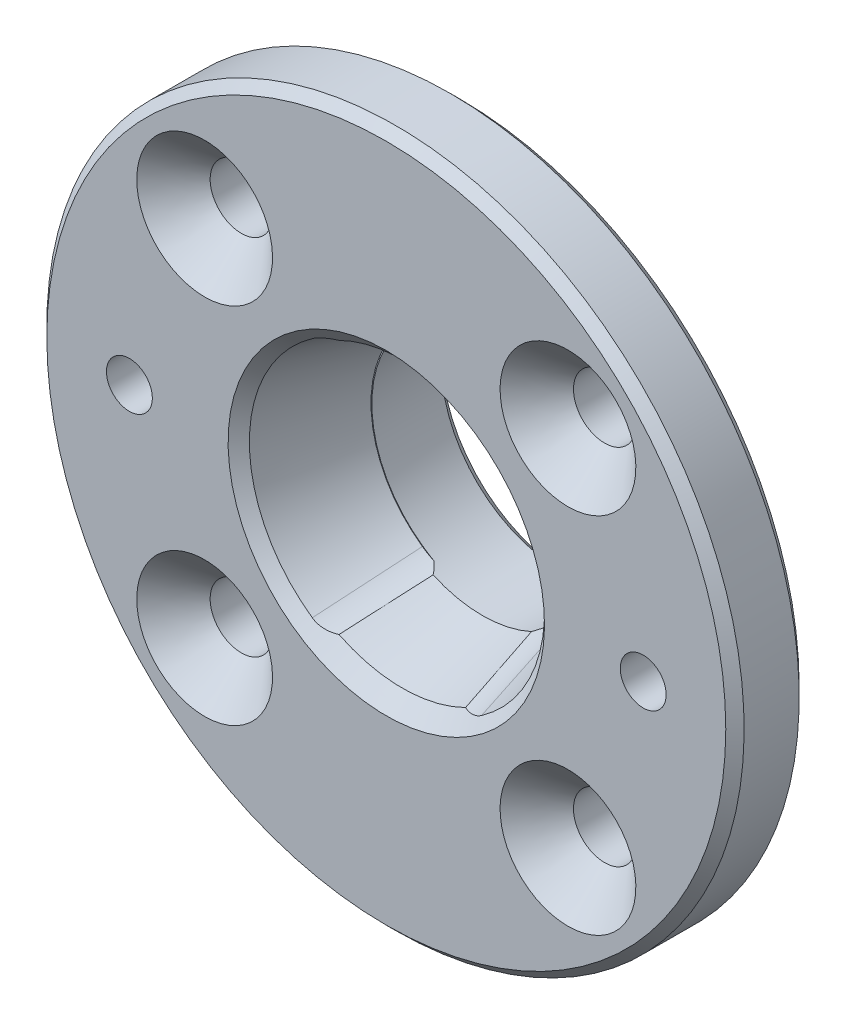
ISO-10303-21;
HEADER;
FILE_DESCRIPTION(('STEP AP214'),'2;1');
FILE_NAME('part.step','',(''),(''),'','','');
FILE_SCHEMA(('AUTOMOTIVE_DESIGN { 1 0 10303 214 1 1 1 1 }'));
ENDSEC;
DATA;
#1=APPLICATION_CONTEXT('core data for automotive mechanical design processes');
#2=APPLICATION_PROTOCOL_DEFINITION('international standard','automotive_design',2000,#1);
#3=PRODUCT_CONTEXT('',#1,'mechanical');
#4=PRODUCT('Part','Part','',(#3));
#5=PRODUCT_RELATED_PRODUCT_CATEGORY('part','',(#4));
#6=PRODUCT_DEFINITION_FORMATION('','',#4);
#7=PRODUCT_DEFINITION_CONTEXT('part definition',#1,'design');
#8=PRODUCT_DEFINITION('design','',#6,#7);
#9=PRODUCT_DEFINITION_SHAPE('','',#8);
#10=(LENGTH_UNIT() NAMED_UNIT(*) SI_UNIT(.MILLI.,.METRE.));
#11=(NAMED_UNIT(*) PLANE_ANGLE_UNIT() SI_UNIT($,.RADIAN.));
#12=(NAMED_UNIT(*) SI_UNIT($,.STERADIAN.) SOLID_ANGLE_UNIT());
#13=UNCERTAINTY_MEASURE_WITH_UNIT(LENGTH_MEASURE(1.E-05),#10,'distance_accuracy_value','');
#14=(GEOMETRIC_REPRESENTATION_CONTEXT(3) GLOBAL_UNCERTAINTY_ASSIGNED_CONTEXT((#13)) GLOBAL_UNIT_ASSIGNED_CONTEXT((#10,
#11,#12)) REPRESENTATION_CONTEXT('',''));
#15=CARTESIAN_POINT('',(0.,0.,0.));
#16=DIRECTION('',(0.,0.,1.));
#17=DIRECTION('',(1.,0.,0.));
#18=AXIS2_PLACEMENT_3D('',#15,#16,#17);
#19=CARTESIAN_POINT('',(0.,0.,-5.23112166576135));
#20=DIRECTION('',(0.,0.,1.));
#21=DIRECTION('',(0.,-1.,0.));
#22=AXIS2_PLACEMENT_3D('',#19,#20,#21);
#23=CONICAL_SURFACE('',#22,6.5,0.279252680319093);
#24=CARTESIAN_POINT('',(0.,0.,-0.871853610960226));
#25=DIRECTION('',(0.,0.,-1.));
#26=DIRECTION('',(0.,1.,0.));
#27=AXIS2_PLACEMENT_3D('',#24,#25,#26);
#28=CIRCLE('',#27,7.75);
#29=CARTESIAN_POINT('',(-3.44849992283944,6.94048617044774,-0.87185361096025));
#30=VERTEX_POINT('',#29);
#31=CARTESIAN_POINT('',(3.44849992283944,6.94048617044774,-0.87185361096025));
#32=VERTEX_POINT('',#31);
#33=EDGE_CURVE('E106',#30,#32,#28,.T.);
#34=ORIENTED_EDGE('',*,*,#33,.F.);
#35=CARTESIAN_POINT('',(-2.67969673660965,5.92186455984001,-5.23132166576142));
#36=CARTESIAN_POINT('',(-2.75792268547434,6.02359861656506,-4.79560211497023));
#37=CARTESIAN_POINT('',(-2.8356512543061,6.12537486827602,-4.3598034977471));
#38=CARTESIAN_POINT('',(-2.9902842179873,6.32900252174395,-3.48807864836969));
#39=CARTESIAN_POINT('',(-3.06718861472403,6.43085392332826,-3.05215241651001));
#40=CARTESIAN_POINT('',(-3.22034411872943,6.6346230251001,-2.18020119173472));
#41=CARTESIAN_POINT('',(-3.29659522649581,6.73654072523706,-1.74417619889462));
#42=CARTESIAN_POINT('',(-3.44855596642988,6.9404349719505,-0.872044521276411));
#43=CARTESIAN_POINT('',(-3.5242655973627,7.04241151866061,-0.435937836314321));
#44=CARTESIAN_POINT('',(-3.59976019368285,7.14441349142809,0.000199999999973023));
#45=B_SPLINE_CURVE_WITH_KNOTS('',3,(#35,#36,#37,#38,#39,#40,#41,#42,#43,#44),.UNSPECIFIED.,.F.,
.F.,(4,2,2,2,4),(0.,1.3626751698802,2.72534721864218,4.08801822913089,5.45069234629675),.UNSPECIFIED.);
#46=CARTESIAN_POINT('',(-2.67973264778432,5.92191125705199,-5.23112166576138));
#47=VERTEX_POINT('',#46);
#48=EDGE_CURVE('E245',#47,#30,#45,.T.);
#49=ORIENTED_EDGE('',*,*,#48,.F.);
#50=CARTESIAN_POINT('',(0.,0.,-5.23112166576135));
#51=DIRECTION('',(0.,0.,1.));
#52=DIRECTION('',(0.,-1.,0.));
#53=AXIS2_PLACEMENT_3D('',#50,#51,#52);
#54=CIRCLE('',#53,6.5);
#55=CARTESIAN_POINT('',(2.67973264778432,5.92191125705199,-5.23112166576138));
#56=VERTEX_POINT('',#55);
#57=EDGE_CURVE('E126',#56,#47,#54,.T.);
#58=ORIENTED_EDGE('',*,*,#57,.F.);
#59=CARTESIAN_POINT('',(3.59976019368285,7.14441349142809,0.000199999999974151));
#60=CARTESIAN_POINT('',(3.5242655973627,7.04241151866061,-0.435937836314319));
#61=CARTESIAN_POINT('',(3.44855596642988,6.9404349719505,-0.872044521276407));
#62=CARTESIAN_POINT('',(3.29659522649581,6.73654072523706,-1.74417619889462));
#63=CARTESIAN_POINT('',(3.22034411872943,6.6346230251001,-2.18020119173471));
#64=CARTESIAN_POINT('',(3.06718861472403,6.43085392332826,-3.05215241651));
#65=CARTESIAN_POINT('',(2.99028421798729,6.32900252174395,-3.48807864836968));
#66=CARTESIAN_POINT('',(2.8356512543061,6.12537486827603,-4.35980349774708));
#67=CARTESIAN_POINT('',(2.75792268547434,6.02359861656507,-4.79560211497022));
#68=CARTESIAN_POINT('',(2.67969673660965,5.92186455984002,-5.2313216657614));
#69=B_SPLINE_CURVE_WITH_KNOTS('',3,(#59,#60,#61,#62,#63,#64,#65,#66,#67,#68),.UNSPECIFIED.,.F.,
.F.,(4,2,2,2,4),(0.,1.36267411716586,2.72534512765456,4.08801717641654,5.45069234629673),.UNSPECIFIED.);
#70=EDGE_CURVE('E119',#32,#56,#69,.T.);
#71=ORIENTED_EDGE('',*,*,#70,.F.);
#72=EDGE_LOOP('',(#34,#49,#58,#71));
#73=FACE_BOUND('',#72,.T.);
#74=ADVANCED_FACE('F16',(#73),#23,.F.);
#75=CARTESIAN_POINT('',(0.,0.,0.));
#76=DIRECTION('',(0.,0.,1.));
#77=DIRECTION('',(0.,-1.,0.));
#78=AXIS2_PLACEMENT_3D('',#75,#76,#77);
#79=CYLINDRICAL_SURFACE('',#78,6.5);
#80=CARTESIAN_POINT('',(0.,0.,-3.84872790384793));
#81=DIRECTION('',(0.15809909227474,0.225788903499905,-0.96126169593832));
#82=DIRECTION('',(0.551357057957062,0.787419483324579,0.275637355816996));
#83=AXIS2_PLACEMENT_3D('',#80,#81,#82);
#84=ELLIPSE('',#83,6.76194633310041,6.5);
#85=CARTESIAN_POINT('',(-3.10143057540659,-5.71236626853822,-5.70058810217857));
#86=VERTEX_POINT('',#85);
#87=CARTESIAN_POINT('',(-3.72824683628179,-5.32448828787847,-5.71257291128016));
#88=VERTEX_POINT('',#87);
#89=EDGE_CURVE('E323',#86,#88,#84,.T.);
#90=ORIENTED_EDGE('',*,*,#89,.F.);
#91=CARTESIAN_POINT('',(-2.67973264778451,-5.9219112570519,-5.23112166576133));
#92=CARTESIAN_POINT('',(-2.7105630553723,-5.90795561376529,-5.27541786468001));
#93=CARTESIAN_POINT('',(-2.74241721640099,-5.89325556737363,-5.31880643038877));
#94=CARTESIAN_POINT('',(-2.80811794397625,-5.86223503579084,-5.40301267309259));
#95=CARTESIAN_POINT('',(-2.84195237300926,-5.84592407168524,-5.44384336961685));
#96=CARTESIAN_POINT('',(-2.91191436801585,-5.8113919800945,-5.52270075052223));
#97=CARTESIAN_POINT('',(-2.94804283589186,-5.79317009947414,-5.56072631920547));
#98=CARTESIAN_POINT('',(-3.02284584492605,-5.75449149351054,-5.63343217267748));
#99=CARTESIAN_POINT('',(-3.06153357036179,-5.73402276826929,-5.66809242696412));
#100=CARTESIAN_POINT('',(-3.1014305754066,-5.71236626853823,-5.70058810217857));
#101=B_SPLINE_CURVE_WITH_KNOTS('',3,(#91,#92,#93,#94,#95,#96,#97,#98,#99,#100),.UNSPECIFIED.,
.F.,.F.,(4,2,2,2,4),(0.,0.167255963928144,0.333576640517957,0.49996311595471,0.667285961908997),.UNSPECIFIED.);
#102=CARTESIAN_POINT('',(-2.67973264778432,-5.92191125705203,-5.23112166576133));
#103=VERTEX_POINT('',#102);
#104=EDGE_CURVE('E836',#103,#86,#101,.T.);
#105=ORIENTED_EDGE('',*,*,#104,.F.);
#106=CARTESIAN_POINT('',(2.67973264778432,-5.92191125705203,-5.23112166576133));
#107=VERTEX_POINT('',#106);
#108=EDGE_CURVE('E328',#103,#107,#54,.T.);
#109=ORIENTED_EDGE('',*,*,#108,.T.);
#110=CARTESIAN_POINT('',(3.10143057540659,-5.71236626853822,-5.70058810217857));
#111=CARTESIAN_POINT('',(3.06153357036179,-5.73402276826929,-5.66809242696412));
#112=CARTESIAN_POINT('',(3.02284584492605,-5.75449149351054,-5.63343217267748));
#113=CARTESIAN_POINT('',(2.94804283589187,-5.79317009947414,-5.56072631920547));
#114=CARTESIAN_POINT('',(2.91191436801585,-5.8113919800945,-5.52270075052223));
#115=CARTESIAN_POINT('',(2.84195237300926,-5.84592407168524,-5.44384336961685));
#116=CARTESIAN_POINT('',(2.80811794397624,-5.86223503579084,-5.40301267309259));
#117=CARTESIAN_POINT('',(2.74241721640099,-5.89325556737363,-5.31880643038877));
#118=CARTESIAN_POINT('',(2.7105630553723,-5.90795561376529,-5.27541786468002));
#119=CARTESIAN_POINT('',(2.67973264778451,-5.9219112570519,-5.23112166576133));
#120=B_SPLINE_CURVE_WITH_KNOTS('',3,(#110,#111,#112,#113,#114,#115,#116,#117,#118,#119),
.UNSPECIFIED.,.F.,.F.,(4,2,2,2,4),(0.,0.167322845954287,0.333709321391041,0.500029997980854,
0.667285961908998),.UNSPECIFIED.);
#121=CARTESIAN_POINT('',(3.10143057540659,-5.71236626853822,-5.70058810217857));
#122=VERTEX_POINT('',#121);
#123=EDGE_CURVE('E218',#122,#107,#120,.T.);
#124=ORIENTED_EDGE('',*,*,#123,.F.);
#125=CARTESIAN_POINT('',(0.,0.,-3.84872790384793));
#126=DIRECTION('',(-0.15809909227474,0.225788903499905,-0.96126169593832));
#127=DIRECTION('',(-0.551357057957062,0.787419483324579,0.275637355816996));
#128=AXIS2_PLACEMENT_3D('',#125,#126,#127);
#129=ELLIPSE('',#128,6.76194633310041,6.5);
#130=CARTESIAN_POINT('',(3.72824683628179,-5.32448828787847,-5.71257291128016));
#131=VERTEX_POINT('',#130);
#132=EDGE_CURVE('E132',#131,#122,#129,.T.);
#133=ORIENTED_EDGE('',*,*,#132,.F.);
#134=CARTESIAN_POINT('',(0.,0.,-5.71257291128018));
#135=DIRECTION('',(0.,0.,-1.));
#136=DIRECTION('',(0.,1.,0.));
#137=AXIS2_PLACEMENT_3D('',#134,#135,#136);
#138=CIRCLE('',#137,6.5);
#139=CARTESIAN_POINT('',(3.72824683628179,5.32448828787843,-5.7125729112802));
#140=VERTEX_POINT('',#139);
#141=EDGE_CURVE('E357',#131,#140,#138,.F.);
#142=ORIENTED_EDGE('',*,*,#141,.T.);
#143=CARTESIAN_POINT('',(0.,0.,-3.84872790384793));
#144=DIRECTION('',(-0.15809909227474,-0.225788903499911,-0.961261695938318));
#145=DIRECTION('',(-0.551357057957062,-0.787419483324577,0.275637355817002));
#146=AXIS2_PLACEMENT_3D('',#143,#144,#145);
#147=ELLIPSE('',#146,6.76194633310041,6.5);
#148=CARTESIAN_POINT('',(3.10143057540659,5.71236626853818,-5.70058810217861));
#149=VERTEX_POINT('',#148);
#150=EDGE_CURVE('E130',#149,#140,#147,.T.);
#151=ORIENTED_EDGE('',*,*,#150,.F.);
#152=CARTESIAN_POINT('',(2.67973264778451,5.92191125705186,-5.23112166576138));
#153=CARTESIAN_POINT('',(2.7105630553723,5.90795561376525,-5.27541786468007));
#154=CARTESIAN_POINT('',(2.74241721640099,5.89325556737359,-5.31880643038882));
#155=CARTESIAN_POINT('',(2.80811794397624,5.8622350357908,-5.40301267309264));
#156=CARTESIAN_POINT('',(2.84195237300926,5.8459240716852,-5.44384336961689));
#157=CARTESIAN_POINT('',(2.91191436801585,5.81139198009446,-5.52270075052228));
#158=CARTESIAN_POINT('',(2.94804283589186,5.7931700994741,-5.56072631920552));
#159=CARTESIAN_POINT('',(3.02284584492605,5.7544914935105,-5.63343217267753));
#160=CARTESIAN_POINT('',(3.06153357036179,5.73402276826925,-5.66809242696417));
#161=CARTESIAN_POINT('',(3.1014305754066,5.71236626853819,-5.70058810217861));
#162=B_SPLINE_CURVE_WITH_KNOTS('',3,(#152,#153,#154,#155,#156,#157,#158,#159,#160,#161),
.UNSPECIFIED.,.F.,.F.,(4,2,2,2,4),(0.,0.167255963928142,0.333576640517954,0.499963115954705,
0.667285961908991),.UNSPECIFIED.);
#163=EDGE_CURVE('E127',#56,#149,#162,.T.);
#164=ORIENTED_EDGE('',*,*,#163,.F.);
#165=ORIENTED_EDGE('',*,*,#57,.T.);
#166=CARTESIAN_POINT('',(-3.10143057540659,5.71236626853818,-5.70058810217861));
#167=CARTESIAN_POINT('',(-3.06153357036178,5.73402276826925,-5.66809242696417));
#168=CARTESIAN_POINT('',(-3.02284584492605,5.7544914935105,-5.63343217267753));
#169=CARTESIAN_POINT('',(-2.94804283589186,5.7931700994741,-5.56072631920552));
#170=CARTESIAN_POINT('',(-2.91191436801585,5.81139198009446,-5.52270075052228));
#171=CARTESIAN_POINT('',(-2.84195237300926,5.8459240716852,-5.44384336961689));
#172=CARTESIAN_POINT('',(-2.80811794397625,5.8622350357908,-5.40301267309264));
#173=CARTESIAN_POINT('',(-2.74241721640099,5.89325556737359,-5.31880643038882));
#174=CARTESIAN_POINT('',(-2.7105630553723,5.90795561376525,-5.27541786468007));
#175=CARTESIAN_POINT('',(-2.67973264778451,5.92191125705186,-5.23112166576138));
#176=B_SPLINE_CURVE_WITH_KNOTS('',3,(#166,#167,#168,#169,#170,#171,#172,#173,#174,#175),
.UNSPECIFIED.,.F.,.F.,(4,2,2,2,4),(0.,0.167322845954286,0.333709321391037,0.500029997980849,
0.667285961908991),.UNSPECIFIED.);
#177=CARTESIAN_POINT('',(-3.10143057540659,5.71236626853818,-5.70058810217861));
#178=VERTEX_POINT('',#177);
#179=EDGE_CURVE('E237',#178,#47,#176,.T.);
#180=ORIENTED_EDGE('',*,*,#179,.F.);
#181=CARTESIAN_POINT('',(0.,0.,-3.84872790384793));
#182=DIRECTION('',(0.15809909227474,-0.225788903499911,-0.961261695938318));
#183=DIRECTION('',(0.551357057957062,-0.787419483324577,0.275637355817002));
#184=AXIS2_PLACEMENT_3D('',#181,#182,#183);
#185=ELLIPSE('',#184,6.76194633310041,6.5);
#186=CARTESIAN_POINT('',(-3.72824683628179,5.32448828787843,-5.7125729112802));
#187=VERTEX_POINT('',#186);
#188=EDGE_CURVE('E244',#187,#178,#185,.T.);
#189=ORIENTED_EDGE('',*,*,#188,.F.);
#190=CARTESIAN_POINT('',(0.,0.,-5.71257291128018));
#191=DIRECTION('',(0.,0.,-1.));
#192=DIRECTION('',(0.,1.,0.));
#193=AXIS2_PLACEMENT_3D('',#190,#191,#192);
#194=CIRCLE('',#193,6.5);
#195=EDGE_CURVE('E359',#187,#88,#194,.F.);
#196=ORIENTED_EDGE('',*,*,#195,.T.);
#197=EDGE_LOOP('',(#90,#105,#109,#124,#133,#142,#151,#164,#165,#180,#189,#196));
#198=FACE_BOUND('',#197,.T.);
#199=CARTESIAN_POINT('',(0.,0.,-9.5));
#200=DIRECTION('',(0.,0.,-1.));
#201=DIRECTION('',(0.,1.,0.));
#202=AXIS2_PLACEMENT_3D('',#199,#200,#201);
#203=CIRCLE('',#202,6.5);
#204=CARTESIAN_POINT('',(0.,6.49999999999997,-9.50000000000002));
#205=VERTEX_POINT('',#204);
#206=EDGE_CURVE('E348',#205,#205,#203,.T.);
#207=ORIENTED_EDGE('',*,*,#206,.T.);
#208=EDGE_LOOP('',(#207));
#209=FACE_BOUND('',#208,.T.);
#210=ADVANCED_FACE('F224',(#198,#209),#79,.F.);
#211=CARTESIAN_POINT('',(8.,0.,0.));
#212=DIRECTION('',(0.,0.,1.));
#213=DIRECTION('',(0.,-1.,0.));
#214=AXIS2_PLACEMENT_3D('',#211,#212,#213);
#215=PLANE('',#214);
#216=CARTESIAN_POINT('',(14.,0.,0.));
#217=DIRECTION('',(0.,0.,1.));
#218=DIRECTION('',(0.,-1.,0.));
#219=AXIS2_PLACEMENT_3D('',#216,#217,#218);
#220=CIRCLE('',#219,1.25);
#221=CARTESIAN_POINT('',(14.,-1.25,0.));
#222=VERTEX_POINT('',#221);
#223=EDGE_CURVE('E10',#222,#222,#220,.T.);
#224=ORIENTED_EDGE('',*,*,#223,.F.);
#225=EDGE_LOOP('',(#224));
#226=FACE_BOUND('',#225,.T.);
#227=CARTESIAN_POINT('',(-14.,0.,0.));
#228=DIRECTION('',(0.,0.,1.));
#229=DIRECTION('',(0.,-1.,0.));
#230=AXIS2_PLACEMENT_3D('',#227,#228,#229);
#231=CIRCLE('',#230,1.25);
#232=CARTESIAN_POINT('',(-14.,-1.25,0.));
#233=VERTEX_POINT('',#232);
#234=EDGE_CURVE('E25',#233,#233,#231,.T.);
#235=ORIENTED_EDGE('',*,*,#234,.F.);
#236=EDGE_LOOP('',(#235));
#237=FACE_BOUND('',#236,.T.);
#238=CARTESIAN_POINT('',(0.,0.,0.));
#239=DIRECTION('',(0.,0.,-1.));
#240=DIRECTION('',(0.,1.,0.));
#241=AXIS2_PLACEMENT_3D('',#238,#239,#240);
#242=CIRCLE('',#241,8.62185361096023);
#243=CARTESIAN_POINT('',(0.,8.62185361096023,0.));
#244=VERTEX_POINT('',#243);
#245=EDGE_CURVE('E293',#244,#244,#242,.T.);
#246=ORIENTED_EDGE('',*,*,#245,.T.);
#247=EDGE_LOOP('',(#246));
#248=FACE_BOUND('',#247,.T.);
#249=CARTESIAN_POINT('',(0.,0.,0.));
#250=DIRECTION('',(0.,0.,1.));
#251=DIRECTION('',(0.,-1.,0.));
#252=AXIS2_PLACEMENT_3D('',#249,#250,#251);
#253=CIRCLE('',#252,18.5);
#254=CARTESIAN_POINT('',(0.,-18.5,0.));
#255=VERTEX_POINT('',#254);
#256=EDGE_CURVE('E351',#255,#255,#253,.T.);
#257=ORIENTED_EDGE('',*,*,#256,.T.);
#258=EDGE_LOOP('',(#257));
#259=FACE_BOUND('',#258,.T.);
#260=CARTESIAN_POINT('',(9.8994949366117,9.89949493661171,0.));
#261=DIRECTION('',(0.,0.,1.));
#262=DIRECTION('',(0.,-1.,0.));
#263=AXIS2_PLACEMENT_3D('',#260,#261,#262);
#264=CIRCLE('',#263,3.7);
#265=CARTESIAN_POINT('',(9.8994949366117,6.19949493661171,0.));
#266=VERTEX_POINT('',#265);
#267=EDGE_CURVE('E394',#266,#266,#264,.T.);
#268=ORIENTED_EDGE('',*,*,#267,.F.);
#269=EDGE_LOOP('',(#268));
#270=FACE_BOUND('',#269,.T.);
#271=CARTESIAN_POINT('',(9.89949493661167,-9.89949493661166,0.));
#272=DIRECTION('',(0.,0.,1.));
#273=DIRECTION('',(0.,-1.,0.));
#274=AXIS2_PLACEMENT_3D('',#271,#272,#273);
#275=CIRCLE('',#274,3.7);
#276=CARTESIAN_POINT('',(9.89949493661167,-13.5994949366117,0.));
#277=VERTEX_POINT('',#276);
#278=EDGE_CURVE('E398',#277,#277,#275,.T.);
#279=ORIENTED_EDGE('',*,*,#278,.F.);
#280=EDGE_LOOP('',(#279));
#281=FACE_BOUND('',#280,.T.);
#282=CARTESIAN_POINT('',(-9.89949493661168,-9.89949493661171,0.));
#283=DIRECTION('',(0.,0.,1.));
#284=DIRECTION('',(0.,-1.,0.));
#285=AXIS2_PLACEMENT_3D('',#282,#283,#284);
#286=CIRCLE('',#285,3.7);
#287=CARTESIAN_POINT('',(-9.89949493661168,-13.5994949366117,0.));
#288=VERTEX_POINT('',#287);
#289=EDGE_CURVE('E402',#288,#288,#286,.T.);
#290=ORIENTED_EDGE('',*,*,#289,.F.);
#291=EDGE_LOOP('',(#290));
#292=FACE_BOUND('',#291,.T.);
#293=CARTESIAN_POINT('',(-9.89949493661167,9.89949493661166,0.));
#294=DIRECTION('',(0.,0.,1.));
#295=DIRECTION('',(0.,-1.,0.));
#296=AXIS2_PLACEMENT_3D('',#293,#294,#295);
#297=CIRCLE('',#296,3.7);
#298=CARTESIAN_POINT('',(-9.89949493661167,6.19949493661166,0.));
#299=VERTEX_POINT('',#298);
#300=EDGE_CURVE('E405',#299,#299,#297,.T.);
#301=ORIENTED_EDGE('',*,*,#300,.F.);
#302=EDGE_LOOP('',(#301));
#303=FACE_BOUND('',#302,.T.);
#304=ADVANCED_FACE('F228',(#226,#237,#248,#259,#270,#281,#292,#303),#215,.T.);
#305=CARTESIAN_POINT('',(3.44849992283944,-6.94048617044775,-0.871853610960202));
#306=VERTEX_POINT('',#305);
#307=CARTESIAN_POINT('',(-3.44849992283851,-6.9404861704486,-0.871853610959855));
#308=VERTEX_POINT('',#307);
#309=EDGE_CURVE('E32',#306,#308,#28,.T.);
#310=ORIENTED_EDGE('',*,*,#309,.F.);
#311=CARTESIAN_POINT('',(2.67969673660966,-5.92186455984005,-5.23132166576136));
#312=CARTESIAN_POINT('',(2.75792268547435,-6.0235986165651,-4.79560211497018));
#313=CARTESIAN_POINT('',(2.83565125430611,-6.12537486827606,-4.35980349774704));
#314=CARTESIAN_POINT('',(2.9902842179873,-6.32900252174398,-3.48807864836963));
#315=CARTESIAN_POINT('',(3.06718861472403,-6.43085392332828,-3.05215241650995));
#316=CARTESIAN_POINT('',(3.22034411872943,-6.63462302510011,-2.18020119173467));
#317=CARTESIAN_POINT('',(3.29659522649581,-6.73654072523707,-1.74417619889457));
#318=CARTESIAN_POINT('',(3.44855596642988,-6.9404349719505,-0.872044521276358));
#319=CARTESIAN_POINT('',(3.5242655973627,-7.04241151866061,-0.435937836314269));
#320=CARTESIAN_POINT('',(3.59976019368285,-7.14441349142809,0.000200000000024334));
#321=B_SPLINE_CURVE_WITH_KNOTS('',3,(#311,#312,#313,#314,#315,#316,#317,#318,#319,#320),
.UNSPECIFIED.,.F.,.F.,(4,2,2,2,4),(0.,1.36267516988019,2.72534721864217,4.08801822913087,
5.45069234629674),.UNSPECIFIED.);
#322=EDGE_CURVE('E211',#107,#306,#321,.T.);
#323=ORIENTED_EDGE('',*,*,#322,.F.);
#324=ORIENTED_EDGE('',*,*,#108,.F.);
#325=CARTESIAN_POINT('',(-3.59976019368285,-7.14441349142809,0.000200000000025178));
#326=CARTESIAN_POINT('',(-3.5242655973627,-7.04241151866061,-0.43593783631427));
#327=CARTESIAN_POINT('',(-3.44855596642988,-6.9404349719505,-0.872044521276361));
#328=CARTESIAN_POINT('',(-3.29659522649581,-6.73654072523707,-1.74417619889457));
#329=CARTESIAN_POINT('',(-3.22034411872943,-6.63462302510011,-2.18020119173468));
#330=CARTESIAN_POINT('',(-3.06718861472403,-6.43085392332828,-3.05215241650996));
#331=CARTESIAN_POINT('',(-2.9902842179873,-6.32900252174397,-3.48807864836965));
#332=CARTESIAN_POINT('',(-2.83565125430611,-6.12537486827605,-4.35980349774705));
#333=CARTESIAN_POINT('',(-2.75792268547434,-6.0235986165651,-4.79560211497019));
#334=CARTESIAN_POINT('',(-2.67969673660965,-5.92186455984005,-5.23132166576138));
#335=B_SPLINE_CURVE_WITH_KNOTS('',3,(#325,#326,#327,#328,#329,#330,#331,#332,#333,#334),
.UNSPECIFIED.,.F.,.F.,(4,2,2,2,4),(0.,1.36267411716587,2.72534512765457,4.08801717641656,
5.45069234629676),.UNSPECIFIED.);
#336=EDGE_CURVE('E292',#308,#103,#335,.T.);
#337=ORIENTED_EDGE('',*,*,#336,.F.);
#338=EDGE_LOOP('',(#310,#323,#324,#337));
#339=FACE_BOUND('',#338,.T.);
#340=ADVANCED_FACE('F147',(#339),#23,.F.);
#341=CARTESIAN_POINT('',(6.5,0.,-10.));
#342=DIRECTION('',(0.,0.,-1.));
#343=DIRECTION('',(0.,1.,0.));
#344=AXIS2_PLACEMENT_3D('',#341,#342,#343);
#345=PLANE('',#344);
#346=CARTESIAN_POINT('',(0.,0.,-10.));
#347=DIRECTION('',(0.,0.,-1.));
#348=DIRECTION('',(0.,1.,0.));
#349=AXIS2_PLACEMENT_3D('',#346,#347,#348);
#350=CIRCLE('',#349,7.);
#351=CARTESIAN_POINT('',(0.,6.99999999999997,-10.));
#352=VERTEX_POINT('',#351);
#353=EDGE_CURVE('E345',#352,#352,#350,.F.);
#354=ORIENTED_EDGE('',*,*,#353,.T.);
#355=EDGE_LOOP('',(#354));
#356=FACE_BOUND('',#355,.T.);
#357=CARTESIAN_POINT('',(0.,0.,-10.));
#358=DIRECTION('',(0.,0.,-1.));
#359=DIRECTION('',(0.,1.,0.));
#360=AXIS2_PLACEMENT_3D('',#357,#358,#359);
#361=CIRCLE('',#360,9.4);
#362=CARTESIAN_POINT('',(0.,9.39999999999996,-10.));
#363=VERTEX_POINT('',#362);
#364=EDGE_CURVE('E342',#363,#363,#361,.T.);
#365=ORIENTED_EDGE('',*,*,#364,.T.);
#366=EDGE_LOOP('',(#365));
#367=FACE_BOUND('',#366,.T.);
#368=ADVANCED_FACE('F230',(#356,#367),#345,.T.);
#369=CARTESIAN_POINT('',(0.,0.,0.));
#370=DIRECTION('',(0.,0.,1.));
#371=DIRECTION('',(0.,-1.,0.));
#372=AXIS2_PLACEMENT_3D('',#369,#370,#371);
#373=CYLINDRICAL_SURFACE('',#372,10.);
#374=CARTESIAN_POINT('',(0.,0.,-6.));
#375=DIRECTION('',(0.,0.,1.));
#376=DIRECTION('',(0.,-1.,0.));
#377=AXIS2_PLACEMENT_3D('',#374,#375,#376);
#378=CIRCLE('',#377,10.);
#379=CARTESIAN_POINT('',(0.,-10.,-5.99999999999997));
#380=VERTEX_POINT('',#379);
#381=EDGE_CURVE('E411',#380,#380,#378,.T.);
#382=ORIENTED_EDGE('',*,*,#381,.F.);
#383=EDGE_LOOP('',(#382));
#384=FACE_BOUND('',#383,.T.);
#385=CARTESIAN_POINT('',(0.,0.,-8.4));
#386=DIRECTION('',(0.,0.,1.));
#387=DIRECTION('',(0.,-1.,0.));
#388=AXIS2_PLACEMENT_3D('',#385,#386,#387);
#389=CIRCLE('',#388,10.);
#390=CARTESIAN_POINT('',(0.,-10.,-8.39999999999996));
#391=VERTEX_POINT('',#390);
#392=EDGE_CURVE('E333',#391,#391,#389,.T.);
#393=ORIENTED_EDGE('',*,*,#392,.T.);
#394=EDGE_LOOP('',(#393));
#395=FACE_BOUND('',#394,.T.);
#396=ADVANCED_FACE('F284',(#384,#395),#373,.T.);
#397=CARTESIAN_POINT('',(10.,0.,-4.));
#398=DIRECTION('',(0.,0.,-1.));
#399=DIRECTION('',(0.,1.,0.));
#400=AXIS2_PLACEMENT_3D('',#397,#398,#399);
#401=PLANE('',#400);
#402=CARTESIAN_POINT('',(-9.89949493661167,9.89949493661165,-4.));
#403=DIRECTION('',(0.,0.,-1.));
#404=DIRECTION('',(0.,1.,0.));
#405=AXIS2_PLACEMENT_3D('',#402,#403,#404);
#406=CIRCLE('',#405,1.7);
#407=CARTESIAN_POINT('',(-9.89949493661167,11.5994949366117,-4.00000000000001));
#408=VERTEX_POINT('',#407);
#409=EDGE_CURVE('E378',#408,#408,#406,.T.);
#410=ORIENTED_EDGE('',*,*,#409,.F.);
#411=EDGE_LOOP('',(#410));
#412=FACE_BOUND('',#411,.T.);
#413=CARTESIAN_POINT('',(9.8994949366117,9.8994949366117,-4.));
#414=DIRECTION('',(0.,0.,-1.));
#415=DIRECTION('',(0.,1.,0.));
#416=AXIS2_PLACEMENT_3D('',#413,#414,#415);
#417=CIRCLE('',#416,1.7);
#418=CARTESIAN_POINT('',(9.8994949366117,11.5994949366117,-4.00000000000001));
#419=VERTEX_POINT('',#418);
#420=EDGE_CURVE('E375',#419,#419,#417,.T.);
#421=ORIENTED_EDGE('',*,*,#420,.F.);
#422=EDGE_LOOP('',(#421));
#423=FACE_BOUND('',#422,.T.);
#424=CARTESIAN_POINT('',(9.89949493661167,-9.89949493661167,-4.));
#425=DIRECTION('',(0.,0.,-1.));
#426=DIRECTION('',(0.,1.,0.));
#427=AXIS2_PLACEMENT_3D('',#424,#425,#426);
#428=CIRCLE('',#427,1.7);
#429=CARTESIAN_POINT('',(9.89949493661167,-8.19949493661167,-4.00000000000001));
#430=VERTEX_POINT('',#429);
#431=EDGE_CURVE('E372',#430,#430,#428,.T.);
#432=ORIENTED_EDGE('',*,*,#431,.F.);
#433=EDGE_LOOP('',(#432));
#434=FACE_BOUND('',#433,.T.);
#435=CARTESIAN_POINT('',(-9.89949493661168,-9.89949493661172,-4.));
#436=DIRECTION('',(0.,0.,-1.));
#437=DIRECTION('',(0.,1.,0.));
#438=AXIS2_PLACEMENT_3D('',#435,#436,#437);
#439=CIRCLE('',#438,1.7);
#440=CARTESIAN_POINT('',(-9.89949493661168,-8.19949493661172,-4.00000000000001));
#441=VERTEX_POINT('',#440);
#442=EDGE_CURVE('E367',#441,#441,#439,.T.);
#443=ORIENTED_EDGE('',*,*,#442,.F.);
#444=EDGE_LOOP('',(#443));
#445=FACE_BOUND('',#444,.T.);
#446=CARTESIAN_POINT('',(14.,0.,-4.));
#447=DIRECTION('',(0.,0.,-1.));
#448=DIRECTION('',(0.,1.,0.));
#449=AXIS2_PLACEMENT_3D('',#446,#447,#448);
#450=CIRCLE('',#449,1.25);
#451=CARTESIAN_POINT('',(14.,1.24999999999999,-4.));
#452=VERTEX_POINT('',#451);
#453=EDGE_CURVE('E363',#452,#452,#450,.T.);
#454=ORIENTED_EDGE('',*,*,#453,.F.);
#455=EDGE_LOOP('',(#454));
#456=FACE_BOUND('',#455,.T.);
#457=CARTESIAN_POINT('',(-14.,0.,-4.));
#458=DIRECTION('',(0.,0.,-1.));
#459=DIRECTION('',(0.,1.,0.));
#460=AXIS2_PLACEMENT_3D('',#457,#458,#459);
#461=CIRCLE('',#460,1.25);
#462=CARTESIAN_POINT('',(-14.,1.24999999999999,-4.));
#463=VERTEX_POINT('',#462);
#464=EDGE_CURVE('E360',#463,#463,#461,.T.);
#465=ORIENTED_EDGE('',*,*,#464,.F.);
#466=EDGE_LOOP('',(#465));
#467=FACE_BOUND('',#466,.T.);
#468=CARTESIAN_POINT('',(0.,0.,-4.));
#469=DIRECTION('',(0.,0.,1.));
#470=DIRECTION('',(0.,-1.,0.));
#471=AXIS2_PLACEMENT_3D('',#468,#469,#470);
#472=CIRCLE('',#471,11.);
#473=CARTESIAN_POINT('',(0.,-11.,-3.99999999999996));
#474=VERTEX_POINT('',#473);
#475=EDGE_CURVE('E425',#474,#474,#472,.T.);
#476=ORIENTED_EDGE('',*,*,#475,.T.);
#477=EDGE_LOOP('',(#476));
#478=FACE_BOUND('',#477,.T.);
#479=CARTESIAN_POINT('',(0.,0.,-4.));
#480=DIRECTION('',(0.,0.,-1.));
#481=DIRECTION('',(0.,1.,0.));
#482=AXIS2_PLACEMENT_3D('',#479,#480,#481);
#483=CIRCLE('',#482,18.5);
#484=CARTESIAN_POINT('',(0.,18.5,-4.00000000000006));
#485=VERTEX_POINT('',#484);
#486=EDGE_CURVE('E331',#485,#485,#483,.T.);
#487=ORIENTED_EDGE('',*,*,#486,.T.);
#488=EDGE_LOOP('',(#487));
#489=FACE_BOUND('',#488,.T.);
#490=ADVANCED_FACE('F454',(#412,#423,#434,#445,#456,#467,#478,#489),#401,.T.);
#491=CARTESIAN_POINT('',(0.,0.,0.));
#492=DIRECTION('',(0.,0.,1.));
#493=DIRECTION('',(0.,-1.,0.));
#494=AXIS2_PLACEMENT_3D('',#491,#492,#493);
#495=CYLINDRICAL_SURFACE('',#494,19.);
#496=CARTESIAN_POINT('',(0.,0.,-0.499999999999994));
#497=DIRECTION('',(0.,0.,1.));
#498=DIRECTION('',(0.,-1.,0.));
#499=AXIS2_PLACEMENT_3D('',#496,#497,#498);
#500=CIRCLE('',#499,19.);
#501=CARTESIAN_POINT('',(0.,-19.,-0.499999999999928));
#502=VERTEX_POINT('',#501);
#503=EDGE_CURVE('E354',#502,#502,#500,.F.);
#504=ORIENTED_EDGE('',*,*,#503,.T.);
#505=EDGE_LOOP('',(#504));
#506=FACE_BOUND('',#505,.T.);
#507=CARTESIAN_POINT('',(0.,0.,-3.5));
#508=DIRECTION('',(0.,0.,-1.));
#509=DIRECTION('',(0.,1.,0.));
#510=AXIS2_PLACEMENT_3D('',#507,#508,#509);
#511=CIRCLE('',#510,19.);
#512=CARTESIAN_POINT('',(0.,19.,-3.50000000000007));
#513=VERTEX_POINT('',#512);
#514=EDGE_CURVE('E327',#513,#513,#511,.F.);
#515=ORIENTED_EDGE('',*,*,#514,.T.);
#516=EDGE_LOOP('',(#515));
#517=FACE_BOUND('',#516,.T.);
#518=ADVANCED_FACE('F448',(#506,#517),#495,.T.);
#519=CARTESIAN_POINT('',(0.,0.,-3.5));
#520=DIRECTION('',(0.,0.,1.));
#521=DIRECTION('',(0.,-1.,0.));
#522=AXIS2_PLACEMENT_3D('',#519,#520,#521);
#523=CONICAL_SURFACE('',#522,19.,0.785398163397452);
#524=ORIENTED_EDGE('',*,*,#486,.F.);
#525=EDGE_LOOP('',(#524));
#526=FACE_BOUND('',#525,.T.);
#527=ORIENTED_EDGE('',*,*,#514,.F.);
#528=EDGE_LOOP('',(#527));
#529=FACE_BOUND('',#528,.T.);
#530=ADVANCED_FACE('F438',(#526,#529),#523,.T.);
#531=CARTESIAN_POINT('',(0.,0.,-8.5));
#532=DIRECTION('',(0.,0.,1.));
#533=DIRECTION('',(0.,-1.,0.));
#534=AXIS2_PLACEMENT_3D('',#531,#532,#533);
#535=CONICAL_SURFACE('',#534,9.9,0.785398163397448);
#536=ORIENTED_EDGE('',*,*,#392,.F.);
#537=EDGE_LOOP('',(#536));
#538=FACE_BOUND('',#537,.T.);
#539=CARTESIAN_POINT('',(0.,0.,-8.5));
#540=DIRECTION('',(0.,0.,1.));
#541=DIRECTION('',(0.,-1.,0.));
#542=AXIS2_PLACEMENT_3D('',#539,#540,#541);
#543=CIRCLE('',#542,9.9);
#544=CARTESIAN_POINT('',(0.,-9.90000000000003,-8.49999999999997));
#545=VERTEX_POINT('',#544);
#546=EDGE_CURVE('E427',#545,#545,#543,.T.);
#547=ORIENTED_EDGE('',*,*,#546,.T.);
#548=EDGE_LOOP('',(#547));
#549=FACE_BOUND('',#548,.T.);
#550=ADVANCED_FACE('F435',(#538,#549),#535,.T.);
#551=CARTESIAN_POINT('',(0.,0.,0.));
#552=DIRECTION('',(0.,0.,1.));
#553=DIRECTION('',(0.,-1.,0.));
#554=AXIS2_PLACEMENT_3D('',#551,#552,#553);
#555=CYLINDRICAL_SURFACE('',#554,9.9);
#556=CARTESIAN_POINT('',(0.,0.,-9.5));
#557=DIRECTION('',(0.,0.,-1.));
#558=DIRECTION('',(0.,1.,0.));
#559=AXIS2_PLACEMENT_3D('',#556,#557,#558);
#560=CIRCLE('',#559,9.9);
#561=CARTESIAN_POINT('',(0.,9.89999999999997,-9.50000000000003));
#562=VERTEX_POINT('',#561);
#563=EDGE_CURVE('E339',#562,#562,#560,.F.);
#564=ORIENTED_EDGE('',*,*,#563,.T.);
#565=EDGE_LOOP('',(#564));
#566=FACE_BOUND('',#565,.T.);
#567=ORIENTED_EDGE('',*,*,#546,.F.);
#568=EDGE_LOOP('',(#567));
#569=FACE_BOUND('',#568,.T.);
#570=ADVANCED_FACE('F437',(#566,#569),#555,.T.);
#571=CARTESIAN_POINT('',(0.,0.,-9.5));
#572=DIRECTION('',(0.,0.,1.));
#573=DIRECTION('',(0.,-1.,0.));
#574=AXIS2_PLACEMENT_3D('',#571,#572,#573);
#575=CONICAL_SURFACE('',#574,9.9,0.785398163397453);
#576=ORIENTED_EDGE('',*,*,#364,.F.);
#577=EDGE_LOOP('',(#576));
#578=FACE_BOUND('',#577,.T.);
#579=ORIENTED_EDGE('',*,*,#563,.F.);
#580=EDGE_LOOP('',(#579));
#581=FACE_BOUND('',#580,.T.);
#582=ADVANCED_FACE('F445',(#578,#581),#575,.T.);
#583=CARTESIAN_POINT('',(0.,0.,-3.5));
#584=DIRECTION('',(0.,0.,-1.));
#585=DIRECTION('',(0.,1.,0.));
#586=AXIS2_PLACEMENT_3D('',#583,#584,#585);
#587=CONICAL_SURFACE('',#586,10.5,0.785398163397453);
#588=ORIENTED_EDGE('',*,*,#475,.F.);
#589=EDGE_LOOP('',(#588));
#590=FACE_BOUND('',#589,.T.);
#591=CARTESIAN_POINT('',(0.,0.,-3.5));
#592=DIRECTION('',(0.,0.,1.));
#593=DIRECTION('',(0.,-1.,0.));
#594=AXIS2_PLACEMENT_3D('',#591,#592,#593);
#595=CIRCLE('',#594,10.5);
#596=CARTESIAN_POINT('',(0.,-10.5,-3.49999999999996));
#597=VERTEX_POINT('',#596);
#598=EDGE_CURVE('E422',#597,#597,#595,.T.);
#599=ORIENTED_EDGE('',*,*,#598,.T.);
#600=EDGE_LOOP('',(#599));
#601=FACE_BOUND('',#600,.T.);
#602=ADVANCED_FACE('F487',(#590,#601),#587,.F.);
#603=CARTESIAN_POINT('',(9.5,0.,-3.5));
#604=DIRECTION('',(0.,0.,1.));
#605=DIRECTION('',(0.,-1.,0.));
#606=AXIS2_PLACEMENT_3D('',#603,#604,#605);
#607=PLANE('',#606);
#608=CARTESIAN_POINT('',(0.,0.,-3.5));
#609=DIRECTION('',(0.,0.,1.));
#610=DIRECTION('',(0.,-1.,0.));
#611=AXIS2_PLACEMENT_3D('',#608,#609,#610);
#612=CIRCLE('',#611,9.5);
#613=CARTESIAN_POINT('',(0.,-9.50000000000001,-3.49999999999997));
#614=VERTEX_POINT('',#613);
#615=EDGE_CURVE('E20',#614,#614,#612,.T.);
#616=ORIENTED_EDGE('',*,*,#615,.T.);
#617=EDGE_LOOP('',(#616));
#618=FACE_BOUND('',#617,.T.);
#619=ORIENTED_EDGE('',*,*,#598,.F.);
#620=EDGE_LOOP('',(#619));
#621=FACE_BOUND('',#620,.T.);
#622=ADVANCED_FACE('F478',(#618,#621),#607,.F.);
#623=CARTESIAN_POINT('',(0.,0.,0.));
#624=DIRECTION('',(0.,0.,1.));
#625=DIRECTION('',(0.,-1.,0.));
#626=AXIS2_PLACEMENT_3D('',#623,#624,#625);
#627=CYLINDRICAL_SURFACE('',#626,9.5);
#628=ORIENTED_EDGE('',*,*,#615,.F.);
#629=EDGE_LOOP('',(#628));
#630=FACE_BOUND('',#629,.T.);
#631=CARTESIAN_POINT('',(0.,0.,-5.5));
#632=DIRECTION('',(0.,0.,1.));
#633=DIRECTION('',(0.,-1.,0.));
#634=AXIS2_PLACEMENT_3D('',#631,#632,#633);
#635=CIRCLE('',#634,9.5);
#636=CARTESIAN_POINT('',(0.,-9.50000000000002,-5.49999999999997));
#637=VERTEX_POINT('',#636);
#638=EDGE_CURVE('E419',#637,#637,#635,.T.);
#639=ORIENTED_EDGE('',*,*,#638,.T.);
#640=EDGE_LOOP('',(#639));
#641=FACE_BOUND('',#640,.T.);
#642=ADVANCED_FACE('F468',(#630,#641),#627,.T.);
#643=CARTESIAN_POINT('',(0.,0.,-6.));
#644=DIRECTION('',(0.,0.,-1.));
#645=DIRECTION('',(0.,1.,0.));
#646=AXIS2_PLACEMENT_3D('',#643,#644,#645);
#647=CONICAL_SURFACE('',#646,10.,0.785398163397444);
#648=ORIENTED_EDGE('',*,*,#638,.F.);
#649=EDGE_LOOP('',(#648));
#650=FACE_BOUND('',#649,.T.);
#651=ORIENTED_EDGE('',*,*,#381,.T.);
#652=EDGE_LOOP('',(#651));
#653=FACE_BOUND('',#652,.T.);
#654=ADVANCED_FACE('F465',(#650,#653),#647,.T.);
#655=CARTESIAN_POINT('',(0.,0.,-10.));
#656=DIRECTION('',(0.,0.,-1.));
#657=DIRECTION('',(0.,1.,0.));
#658=AXIS2_PLACEMENT_3D('',#655,#656,#657);
#659=CONICAL_SURFACE('',#658,7.,0.785398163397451);
#660=ORIENTED_EDGE('',*,*,#206,.F.);
#661=EDGE_LOOP('',(#660));
#662=FACE_BOUND('',#661,.T.);
#663=ORIENTED_EDGE('',*,*,#353,.F.);
#664=EDGE_LOOP('',(#663));
#665=FACE_BOUND('',#664,.T.);
#666=ADVANCED_FACE('F467',(#662,#665),#659,.F.);
#667=CARTESIAN_POINT('',(-9.89949493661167,9.89949493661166,0.));
#668=DIRECTION('',(0.,0.,1.));
#669=DIRECTION('',(0.,-1.,0.));
#670=AXIS2_PLACEMENT_3D('',#667,#668,#669);
#671=CYLINDRICAL_SURFACE('',#670,1.7);
#672=CARTESIAN_POINT('',(-9.89949493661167,9.89949493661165,-2.00000000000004));
#673=DIRECTION('',(0.,0.,1.));
#674=DIRECTION('',(0.,-1.,0.));
#675=AXIS2_PLACEMENT_3D('',#672,#673,#674);
#676=CIRCLE('',#675,1.7);
#677=CARTESIAN_POINT('',(-9.89949493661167,8.19949493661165,-2.00000000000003));
#678=VERTEX_POINT('',#677);
#679=EDGE_CURVE('E407',#678,#678,#676,.T.);
#680=ORIENTED_EDGE('',*,*,#679,.T.);
#681=EDGE_LOOP('',(#680));
#682=FACE_BOUND('',#681,.T.);
#683=ORIENTED_EDGE('',*,*,#409,.T.);
#684=EDGE_LOOP('',(#683));
#685=FACE_BOUND('',#684,.T.);
#686=ADVANCED_FACE('F18',(#682,#685),#671,.F.);
#687=CARTESIAN_POINT('',(-9.89949493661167,9.89949493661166,0.));
#688=DIRECTION('',(0.,0.,1.));
#689=DIRECTION('',(0.,-1.,0.));
#690=AXIS2_PLACEMENT_3D('',#687,#688,#689);
#691=CONICAL_SURFACE('',#690,3.7,0.785398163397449);
#692=ORIENTED_EDGE('',*,*,#679,.F.);
#693=EDGE_LOOP('',(#692));
#694=FACE_BOUND('',#693,.T.);
#695=ORIENTED_EDGE('',*,*,#300,.T.);
#696=EDGE_LOOP('',(#695));
#697=FACE_BOUND('',#696,.T.);
#698=ADVANCED_FACE('F483',(#694,#697),#691,.F.);
#699=CARTESIAN_POINT('',(-9.89949493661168,-9.89949493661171,0.));
#700=DIRECTION('',(0.,0.,1.));
#701=DIRECTION('',(0.,-1.,0.));
#702=AXIS2_PLACEMENT_3D('',#699,#700,#701);
#703=CYLINDRICAL_SURFACE('',#702,1.7);
#704=CARTESIAN_POINT('',(-9.89949493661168,-9.89949493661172,-1.99999999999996));
#705=DIRECTION('',(0.,0.,1.));
#706=DIRECTION('',(0.,-1.,0.));
#707=AXIS2_PLACEMENT_3D('',#704,#705,#706);
#708=CIRCLE('',#707,1.7);
#709=CARTESIAN_POINT('',(-9.89949493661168,-11.5994949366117,-1.99999999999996));
#710=VERTEX_POINT('',#709);
#711=EDGE_CURVE('E408',#710,#710,#708,.T.);
#712=ORIENTED_EDGE('',*,*,#711,.T.);
#713=EDGE_LOOP('',(#712));
#714=FACE_BOUND('',#713,.T.);
#715=ORIENTED_EDGE('',*,*,#442,.T.);
#716=EDGE_LOOP('',(#715));
#717=FACE_BOUND('',#716,.T.);
#718=ADVANCED_FACE('F525',(#714,#717),#703,.F.);
#719=CARTESIAN_POINT('',(-9.89949493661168,-9.89949493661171,0.));
#720=DIRECTION('',(0.,0.,1.));
#721=DIRECTION('',(0.,-1.,0.));
#722=AXIS2_PLACEMENT_3D('',#719,#720,#721);
#723=CONICAL_SURFACE('',#722,3.7,0.785398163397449);
#724=ORIENTED_EDGE('',*,*,#711,.F.);
#725=EDGE_LOOP('',(#724));
#726=FACE_BOUND('',#725,.T.);
#727=ORIENTED_EDGE('',*,*,#289,.T.);
#728=EDGE_LOOP('',(#727));
#729=FACE_BOUND('',#728,.T.);
#730=ADVANCED_FACE('F528',(#726,#729),#723,.F.);
#731=CARTESIAN_POINT('',(9.89949493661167,-9.89949493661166,0.));
#732=DIRECTION('',(0.,0.,1.));
#733=DIRECTION('',(0.,-1.,0.));
#734=AXIS2_PLACEMENT_3D('',#731,#732,#733);
#735=CYLINDRICAL_SURFACE('',#734,1.7);
#736=CARTESIAN_POINT('',(9.89949493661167,-9.89949493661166,-1.99999999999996));
#737=DIRECTION('',(0.,0.,1.));
#738=DIRECTION('',(0.,-1.,0.));
#739=AXIS2_PLACEMENT_3D('',#736,#737,#738);
#740=CIRCLE('',#739,1.7);
#741=CARTESIAN_POINT('',(9.89949493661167,-11.5994949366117,-1.99999999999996));
#742=VERTEX_POINT('',#741);
#743=EDGE_CURVE('E564',#742,#742,#740,.T.);
#744=ORIENTED_EDGE('',*,*,#743,.T.);
#745=EDGE_LOOP('',(#744));
#746=FACE_BOUND('',#745,.T.);
#747=ORIENTED_EDGE('',*,*,#431,.T.);
#748=EDGE_LOOP('',(#747));
#749=FACE_BOUND('',#748,.T.);
#750=ADVANCED_FACE('F530',(#746,#749),#735,.F.);
#751=CARTESIAN_POINT('',(9.89949493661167,-9.89949493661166,0.));
#752=DIRECTION('',(0.,0.,1.));
#753=DIRECTION('',(0.,-1.,0.));
#754=AXIS2_PLACEMENT_3D('',#751,#752,#753);
#755=CONICAL_SURFACE('',#754,3.7,0.785398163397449);
#756=ORIENTED_EDGE('',*,*,#743,.F.);
#757=EDGE_LOOP('',(#756));
#758=FACE_BOUND('',#757,.T.);
#759=ORIENTED_EDGE('',*,*,#278,.T.);
#760=EDGE_LOOP('',(#759));
#761=FACE_BOUND('',#760,.T.);
#762=ADVANCED_FACE('F532',(#758,#761),#755,.F.);
#763=CARTESIAN_POINT('',(9.8994949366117,9.89949493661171,0.));
#764=DIRECTION('',(0.,0.,1.));
#765=DIRECTION('',(0.,-1.,0.));
#766=AXIS2_PLACEMENT_3D('',#763,#764,#765);
#767=CYLINDRICAL_SURFACE('',#766,1.7);
#768=CARTESIAN_POINT('',(9.8994949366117,9.8994949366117,-2.00000000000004));
#769=DIRECTION('',(0.,0.,1.));
#770=DIRECTION('',(0.,-1.,0.));
#771=AXIS2_PLACEMENT_3D('',#768,#769,#770);
#772=CIRCLE('',#771,1.7);
#773=CARTESIAN_POINT('',(9.8994949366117,8.1994949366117,-2.00000000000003));
#774=VERTEX_POINT('',#773);
#775=EDGE_CURVE('E549',#774,#774,#772,.T.);
#776=ORIENTED_EDGE('',*,*,#775,.T.);
#777=EDGE_LOOP('',(#776));
#778=FACE_BOUND('',#777,.T.);
#779=ORIENTED_EDGE('',*,*,#420,.T.);
#780=EDGE_LOOP('',(#779));
#781=FACE_BOUND('',#780,.T.);
#782=ADVANCED_FACE('F534',(#778,#781),#767,.F.);
#783=CARTESIAN_POINT('',(9.8994949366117,9.89949493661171,0.));
#784=DIRECTION('',(0.,0.,1.));
#785=DIRECTION('',(0.,-1.,0.));
#786=AXIS2_PLACEMENT_3D('',#783,#784,#785);
#787=CONICAL_SURFACE('',#786,3.7,0.785398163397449);
#788=ORIENTED_EDGE('',*,*,#775,.F.);
#789=EDGE_LOOP('',(#788));
#790=FACE_BOUND('',#789,.T.);
#791=ORIENTED_EDGE('',*,*,#267,.T.);
#792=EDGE_LOOP('',(#791));
#793=FACE_BOUND('',#792,.T.);
#794=ADVANCED_FACE('F517',(#790,#793),#787,.F.);
#795=CARTESIAN_POINT('',(0.,0.,0.));
#796=DIRECTION('',(0.,0.,-1.));
#797=DIRECTION('',(0.,1.,0.));
#798=AXIS2_PLACEMENT_3D('',#795,#796,#797);
#799=CONICAL_SURFACE('',#798,18.5,0.785398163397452);
#800=ORIENTED_EDGE('',*,*,#503,.F.);
#801=EDGE_LOOP('',(#800));
#802=FACE_BOUND('',#801,.T.);
#803=ORIENTED_EDGE('',*,*,#256,.F.);
#804=EDGE_LOOP('',(#803));
#805=FACE_BOUND('',#804,.T.);
#806=ADVANCED_FACE('F513',(#802,#805),#799,.T.);
#807=CARTESIAN_POINT('',(0.,0.,-5.73112166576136));
#808=DIRECTION('',(0.,0.,-1.));
#809=DIRECTION('',(0.,1.,0.));
#810=AXIS2_PLACEMENT_3D('',#807,#808,#809);
#811=CONICAL_SURFACE('',#810,6.56468719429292,1.2915436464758);
#812=DIRECTION('',(-0.551357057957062,0.787419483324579,0.275637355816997));
#813=VECTOR('',#812,1.);
#814=CARTESIAN_POINT('',(3.76534988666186,-5.37747693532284,-5.73112166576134));
#815=LINE('',#814,#813);
#816=CARTESIAN_POINT('',(3.76534988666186,-5.37747693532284,-5.73112166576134));
#817=VERTEX_POINT('',#816);
#818=EDGE_CURVE('E591',#817,#131,#815,.T.);
#819=ORIENTED_EDGE('',*,*,#818,.F.);
#820=CARTESIAN_POINT('',(0.,0.,-5.73112166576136));
#821=DIRECTION('',(0.,0.,-1.));
#822=DIRECTION('',(0.,1.,0.));
#823=AXIS2_PLACEMENT_3D('',#820,#821,#822);
#824=CIRCLE('',#823,6.56468719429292);
#825=CARTESIAN_POINT('',(3.76534988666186,5.3774769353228,-5.73112166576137));
#826=VERTEX_POINT('',#825);
#827=EDGE_CURVE('E566',#826,#817,#824,.T.);
#828=ORIENTED_EDGE('',*,*,#827,.F.);
#829=DIRECTION('',(-0.551357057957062,-0.787419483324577,0.275637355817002));
#830=VECTOR('',#829,1.);
#831=CARTESIAN_POINT('',(3.76534988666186,5.3774769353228,-5.73112166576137));
#832=LINE('',#831,#830);
#833=EDGE_CURVE('E596',#826,#140,#832,.T.);
#834=ORIENTED_EDGE('',*,*,#833,.T.);
#835=ORIENTED_EDGE('',*,*,#141,.F.);
#836=EDGE_LOOP('',(#819,#828,#834,#835));
#837=FACE_BOUND('',#836,.T.);
#838=ADVANCED_FACE('F516',(#837),#811,.T.);
#839=CARTESIAN_POINT('',(0.,0.,0.));
#840=DIRECTION('',(0.,0.,1.));
#841=DIRECTION('',(0.,-1.,0.));
#842=AXIS2_PLACEMENT_3D('',#839,#840,#841);
#843=CONICAL_SURFACE('',#842,8.20805988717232,0.279252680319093);
#844=CARTESIAN_POINT('',(0.,0.,-0.580148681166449));
#845=DIRECTION('',(0.,0.,1.));
#846=DIRECTION('',(0.,-1.,0.));
#847=AXIS2_PLACEMENT_3D('',#844,#845,#846);
#848=CIRCLE('',#847,8.04170492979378);
#849=CARTESIAN_POINT('',(4.61253245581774,6.58737903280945,-0.580148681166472));
#850=VERTEX_POINT('',#849);
#851=CARTESIAN_POINT('',(4.61253245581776,-6.58737903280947,-0.580148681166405));
#852=VERTEX_POINT('',#851);
#853=EDGE_CURVE('E122',#850,#852,#848,.F.);
#854=ORIENTED_EDGE('',*,*,#853,.F.);
#855=DIRECTION('',(-0.15809909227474,-0.225788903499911,-0.961261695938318));
#856=VECTOR('',#855,1.);
#857=CARTESIAN_POINT('',(4.70794973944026,6.72364903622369,0.));
#858=LINE('',#857,#856);
#859=EDGE_CURVE('E40',#850,#826,#858,.T.);
#860=ORIENTED_EDGE('',*,*,#859,.T.);
#861=ORIENTED_EDGE('',*,*,#827,.T.);
#862=DIRECTION('',(-0.15809909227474,0.225788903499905,-0.96126169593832));
#863=VECTOR('',#862,1.);
#864=CARTESIAN_POINT('',(4.70794973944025,-6.72364903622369,0.));
#865=LINE('',#864,#863);
#866=EDGE_CURVE('E588',#852,#817,#865,.T.);
#867=ORIENTED_EDGE('',*,*,#866,.F.);
#868=EDGE_LOOP('',(#854,#860,#861,#867));
#869=FACE_BOUND('',#868,.T.);
#870=ADVANCED_FACE('F580',(#869),#843,.F.);
#871=CARTESIAN_POINT('',(3.76534988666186,5.37747693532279,-5.73112166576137));
#872=DIRECTION('',(-0.15809909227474,-0.225788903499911,-0.961261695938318));
#873=DIRECTION('',(0.,0.973505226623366,-0.228664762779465));
#874=AXIS2_PLACEMENT_3D('',#871,#872,#873);
#875=PLANE('',#874);
#876=ORIENTED_EDGE('',*,*,#150,.T.);
#877=ORIENTED_EDGE('',*,*,#833,.F.);
#878=CARTESIAN_POINT('',(2.38695724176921,3.40892822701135,-5.04202827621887));
#879=DIRECTION('',(-0.15809909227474,-0.225788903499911,-0.961261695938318));
#880=DIRECTION('',(0.,0.973505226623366,-0.228664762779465));
#881=AXIS2_PLACEMENT_3D('',#878,#879,#880);
#882=CIRCLE('',#881,2.5);
#883=EDGE_CURVE('E128',#149,#826,#882,.T.);
#884=ORIENTED_EDGE('',*,*,#883,.F.);
#885=EDGE_LOOP('',(#876,#877,#884));
#886=FACE_BOUND('',#885,.T.);
#887=ADVANCED_FACE('F155',(#886),#875,.F.);
#888=CARTESIAN_POINT('',(2.38695724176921,3.40892822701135,-5.04202827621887));
#889=DIRECTION('',(-0.15809909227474,-0.225788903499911,-0.961261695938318));
#890=DIRECTION('',(0.,0.973505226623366,-0.228664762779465));
#891=AXIS2_PLACEMENT_3D('',#888,#889,#890);
#892=CYLINDRICAL_SURFACE('',#891,2.5);
#893=ORIENTED_EDGE('',*,*,#859,.F.);
#894=CARTESIAN_POINT('',(4.70814973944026,6.51578335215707,-0.583065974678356));
#895=CARTESIAN_POINT('',(4.67012533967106,6.54621406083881,-0.58067548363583));
#896=CARTESIAN_POINT('',(4.63084379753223,6.57517956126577,-0.579757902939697));
#897=CARTESIAN_POINT('',(4.55020593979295,6.6299328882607,-0.580831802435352));
#898=CARTESIAN_POINT('',(4.50885123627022,6.65572313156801,-0.582821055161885));
#899=CARTESIAN_POINT('',(4.42487705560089,6.70368042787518,-0.589633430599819));
#900=CARTESIAN_POINT('',(4.38227475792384,6.72588171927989,-0.594427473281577));
#901=CARTESIAN_POINT('',(4.29584875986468,6.76688159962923,-0.606696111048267));
#902=CARTESIAN_POINT('',(4.25202495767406,6.78567990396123,-0.614170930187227));
#903=CARTESIAN_POINT('',(4.11961490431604,6.83683253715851,-0.64031859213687));
#904=CARTESIAN_POINT('',(4.02976392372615,6.86412772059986,-0.662742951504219));
#905=CARTESIAN_POINT('',(3.84947221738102,6.90599764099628,-0.715948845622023));
#906=CARTESIAN_POINT('',(3.75903058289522,6.92054077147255,-0.746750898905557));
#907=CARTESIAN_POINT('',(3.63209775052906,6.93315959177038,-0.795000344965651));
#908=CARTESIAN_POINT('',(3.59495153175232,6.93589218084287,-0.809738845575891));
#909=CARTESIAN_POINT('',(3.52115520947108,6.93952227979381,-0.840184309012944));
#910=CARTESIAN_POINT('',(3.48450365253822,6.94042770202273,-0.855886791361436));
#911=CARTESIAN_POINT('',(3.4480489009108,6.94048692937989,-0.872053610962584));
#912=B_SPLINE_CURVE_WITH_KNOTS('',3,(#894,#895,#896,#897,#898,#899,#900,#901,#902,#903,#904,
#905,#906,#907,#908,#909,#910,#911),.UNSPECIFIED.,.F.,.F.,(4,2,2,2,2,2,2,2,4),(0.,
0.146213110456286,0.292314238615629,0.436926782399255,0.581551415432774,0.869692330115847,
1.15854541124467,1.27867268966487,1.39827864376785),.UNSPECIFIED.);
#913=EDGE_CURVE('E109',#850,#32,#912,.T.);
#914=ORIENTED_EDGE('',*,*,#913,.T.);
#915=ORIENTED_EDGE('',*,*,#70,.T.);
#916=ORIENTED_EDGE('',*,*,#163,.T.);
#917=ORIENTED_EDGE('',*,*,#883,.T.);
#918=EDGE_LOOP('',(#893,#914,#915,#916,#917));
#919=FACE_BOUND('',#918,.T.);
#920=ADVANCED_FACE('F118',(#919),#892,.F.);
#921=CARTESIAN_POINT('',(3.76534988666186,-5.37747693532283,-5.73112166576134));
#922=DIRECTION('',(-0.15809909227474,0.225788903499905,-0.96126169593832));
#923=DIRECTION('',(0.,-0.973505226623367,-0.228664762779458));
#924=AXIS2_PLACEMENT_3D('',#921,#922,#923);
#925=PLANE('',#924);
#926=ORIENTED_EDGE('',*,*,#132,.T.);
#927=CARTESIAN_POINT('',(2.38695724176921,-3.40892822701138,-5.04202827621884));
#928=DIRECTION('',(0.15809909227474,-0.225788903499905,0.96126169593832));
#929=DIRECTION('',(0.,-0.973505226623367,-0.228664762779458));
#930=AXIS2_PLACEMENT_3D('',#927,#928,#929);
#931=CIRCLE('',#930,2.5);
#932=EDGE_CURVE('E297',#122,#817,#931,.T.);
#933=ORIENTED_EDGE('',*,*,#932,.T.);
#934=ORIENTED_EDGE('',*,*,#818,.T.);
#935=EDGE_LOOP('',(#926,#933,#934));
#936=FACE_BOUND('',#935,.T.);
#937=ADVANCED_FACE('F154',(#936),#925,.F.);
#938=CARTESIAN_POINT('',(2.38695724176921,-3.40892822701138,-5.04202827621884));
#939=DIRECTION('',(-0.15809909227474,0.225788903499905,-0.96126169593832));
#940=DIRECTION('',(0.,-0.973505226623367,-0.228664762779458));
#941=AXIS2_PLACEMENT_3D('',#938,#939,#940);
#942=CYLINDRICAL_SURFACE('',#941,2.5);
#943=ORIENTED_EDGE('',*,*,#322,.T.);
#944=CARTESIAN_POINT('',(3.44804890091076,-6.9404869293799,-0.872053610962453));
#945=CARTESIAN_POINT('',(3.53751517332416,-6.94038240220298,-0.832350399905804));
#946=CARTESIAN_POINT('',(3.62853469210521,-6.93508745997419,-0.795342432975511));
#947=CARTESIAN_POINT('',(3.81259987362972,-6.91242705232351,-0.728182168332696));
#948=CARTESIAN_POINT('',(3.90565671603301,-6.89494018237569,-0.698102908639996));
#949=CARTESIAN_POINT('',(4.09148691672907,-6.84596903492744,-0.646959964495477));
#950=CARTESIAN_POINT('',(4.18425352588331,-6.81438586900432,-0.625962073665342));
#951=CARTESIAN_POINT('',(4.36496999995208,-6.73663093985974,-0.595283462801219));
#952=CARTESIAN_POINT('',(4.4529456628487,-6.69054880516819,-0.585534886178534));
#953=CARTESIAN_POINT('',(4.56642387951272,-6.61905102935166,-0.580534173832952));
#954=CARTESIAN_POINT('',(4.59556209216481,-6.59952196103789,-0.579985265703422));
#955=CARTESIAN_POINT('',(4.65272695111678,-6.55884283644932,-0.580394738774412));
#956=CARTESIAN_POINT('',(4.68075219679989,-6.53769083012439,-0.581354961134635));
#957=CARTESIAN_POINT('',(4.70814973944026,-6.51578335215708,-0.58306597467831));
#958=B_SPLINE_CURVE_WITH_KNOTS('',3,(#944,#945,#946,#947,#948,#949,#950,#951,#952,#953,#954,
#955,#956,#957),.UNSPECIFIED.,.F.,.F.,(4,2,2,2,2,2,4),(0.,0.293971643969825,0.590913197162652,
0.889971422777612,1.1872161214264,1.29239246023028,1.3976972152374),.UNSPECIFIED.);
#959=EDGE_CURVE('E195',#306,#852,#958,.T.);
#960=ORIENTED_EDGE('',*,*,#959,.T.);
#961=ORIENTED_EDGE('',*,*,#866,.T.);
#962=ORIENTED_EDGE('',*,*,#932,.F.);
#963=ORIENTED_EDGE('',*,*,#123,.T.);
#964=EDGE_LOOP('',(#943,#960,#961,#962,#963));
#965=FACE_BOUND('',#964,.T.);
#966=ADVANCED_FACE('F201',(#965),#942,.F.);
#967=CARTESIAN_POINT('',(0.,0.,-5.73112166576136));
#968=DIRECTION('',(0.,0.,-1.));
#969=DIRECTION('',(0.,1.,0.));
#970=AXIS2_PLACEMENT_3D('',#967,#968,#969);
#971=CONICAL_SURFACE('',#970,6.56468719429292,1.2915436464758);
#972=DIRECTION('',(0.551357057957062,-0.787419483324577,0.275637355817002));
#973=VECTOR('',#972,1.);
#974=CARTESIAN_POINT('',(-3.76534988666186,5.3774769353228,-5.73112166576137));
#975=LINE('',#974,#973);
#976=CARTESIAN_POINT('',(-3.76534988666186,5.3774769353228,-5.73112166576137));
#977=VERTEX_POINT('',#976);
#978=EDGE_CURVE('E302',#977,#187,#975,.T.);
#979=ORIENTED_EDGE('',*,*,#978,.F.);
#980=CARTESIAN_POINT('',(0.,0.,-5.73112166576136));
#981=DIRECTION('',(0.,0.,1.));
#982=DIRECTION('',(0.,1.,0.));
#983=AXIS2_PLACEMENT_3D('',#980,#981,#982);
#984=CIRCLE('',#983,6.56468719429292);
#985=CARTESIAN_POINT('',(-3.76534988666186,-5.37747693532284,-5.73112166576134));
#986=VERTEX_POINT('',#985);
#987=EDGE_CURVE('E299',#977,#986,#984,.T.);
#988=ORIENTED_EDGE('',*,*,#987,.T.);
#989=DIRECTION('',(0.551357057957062,0.787419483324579,0.275637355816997));
#990=VECTOR('',#989,1.);
#991=CARTESIAN_POINT('',(-3.76534988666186,-5.37747693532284,-5.73112166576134));
#992=LINE('',#991,#990);
#993=EDGE_CURVE('E308',#986,#88,#992,.T.);
#994=ORIENTED_EDGE('',*,*,#993,.T.);
#995=ORIENTED_EDGE('',*,*,#195,.F.);
#996=EDGE_LOOP('',(#979,#988,#994,#995));
#997=FACE_BOUND('',#996,.T.);
#998=ADVANCED_FACE('F205',(#997),#971,.T.);
#999=CARTESIAN_POINT('',(0.,0.,0.));
#1000=DIRECTION('',(0.,0.,1.));
#1001=DIRECTION('',(0.,-1.,0.));
#1002=AXIS2_PLACEMENT_3D('',#999,#1000,#1001);
#1003=CONICAL_SURFACE('',#1002,8.20805988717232,0.279252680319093);
#1004=CARTESIAN_POINT('',(0.,0.,-0.580148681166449));
#1005=DIRECTION('',(0.,0.,1.));
#1006=DIRECTION('',(0.,-1.,0.));
#1007=AXIS2_PLACEMENT_3D('',#1004,#1005,#1006);
#1008=CIRCLE('',#1007,8.04170492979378);
#1009=CARTESIAN_POINT('',(-4.61253245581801,-6.58737903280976,-0.580148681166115));
#1010=VERTEX_POINT('',#1009);
#1011=CARTESIAN_POINT('',(-4.61253245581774,6.58737903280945,-0.580148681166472));
#1012=VERTEX_POINT('',#1011);
#1013=EDGE_CURVE('E838',#1010,#1012,#1008,.F.);
#1014=ORIENTED_EDGE('',*,*,#1013,.F.);
#1015=DIRECTION('',(0.15809909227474,0.225788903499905,-0.96126169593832));
#1016=VECTOR('',#1015,1.);
#1017=CARTESIAN_POINT('',(-4.70794973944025,-6.72364903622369,0.));
#1018=LINE('',#1017,#1016);
#1019=EDGE_CURVE('E310',#1010,#986,#1018,.T.);
#1020=ORIENTED_EDGE('',*,*,#1019,.T.);
#1021=ORIENTED_EDGE('',*,*,#987,.F.);
#1022=DIRECTION('',(0.15809909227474,-0.225788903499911,-0.961261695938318));
#1023=VECTOR('',#1022,1.);
#1024=CARTESIAN_POINT('',(-4.70794973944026,6.72364903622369,0.));
#1025=LINE('',#1024,#1023);
#1026=EDGE_CURVE('E306',#1012,#977,#1025,.T.);
#1027=ORIENTED_EDGE('',*,*,#1026,.F.);
#1028=EDGE_LOOP('',(#1014,#1020,#1021,#1027));
#1029=FACE_BOUND('',#1028,.T.);
#1030=ADVANCED_FACE('F262',(#1029),#1003,.F.);
#1031=CARTESIAN_POINT('',(-3.76534988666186,5.37747693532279,-5.73112166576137));
#1032=DIRECTION('',(0.15809909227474,-0.225788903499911,-0.961261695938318));
#1033=DIRECTION('',(0.,0.973505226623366,-0.228664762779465));
#1034=AXIS2_PLACEMENT_3D('',#1031,#1032,#1033);
#1035=PLANE('',#1034);
#1036=ORIENTED_EDGE('',*,*,#188,.T.);
#1037=CARTESIAN_POINT('',(-2.38695724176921,3.40892822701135,-5.04202827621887));
#1038=DIRECTION('',(-0.15809909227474,0.225788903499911,0.961261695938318));
#1039=DIRECTION('',(0.,0.973505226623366,-0.228664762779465));
#1040=AXIS2_PLACEMENT_3D('',#1037,#1038,#1039);
#1041=CIRCLE('',#1040,2.5);
#1042=EDGE_CURVE('E317',#178,#977,#1041,.T.);
#1043=ORIENTED_EDGE('',*,*,#1042,.T.);
#1044=ORIENTED_EDGE('',*,*,#978,.T.);
#1045=EDGE_LOOP('',(#1036,#1043,#1044));
#1046=FACE_BOUND('',#1045,.T.);
#1047=ADVANCED_FACE('F257',(#1046),#1035,.F.);
#1048=CARTESIAN_POINT('',(-2.38695724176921,3.40892822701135,-5.04202827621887));
#1049=DIRECTION('',(0.15809909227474,-0.225788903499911,-0.961261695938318));
#1050=DIRECTION('',(0.,0.973505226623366,-0.228664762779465));
#1051=AXIS2_PLACEMENT_3D('',#1048,#1049,#1050);
#1052=CYLINDRICAL_SURFACE('',#1051,2.5);
#1053=ORIENTED_EDGE('',*,*,#48,.T.);
#1054=CARTESIAN_POINT('',(-3.44804890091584,6.94048692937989,-0.87205361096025));
#1055=CARTESIAN_POINT('',(-3.53751517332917,6.94038240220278,-0.832350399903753));
#1056=CARTESIAN_POINT('',(-3.62853469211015,6.93508745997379,-0.795342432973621));
#1057=CARTESIAN_POINT('',(-3.81259987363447,6.91242705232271,-0.728182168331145));
#1058=CARTESIAN_POINT('',(-3.90565671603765,6.89494018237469,-0.698102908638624));
#1059=CARTESIAN_POINT('',(-4.09148691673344,6.84596903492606,-0.646959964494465));
#1060=CARTESIAN_POINT('',(-4.18425352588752,6.81438586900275,-0.625962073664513));
#1061=CARTESIAN_POINT('',(-4.36496999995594,6.73663093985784,-0.595283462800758));
#1062=CARTESIAN_POINT('',(-4.45294566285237,6.69054880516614,-0.585534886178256));
#1063=CARTESIAN_POINT('',(-4.56642387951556,6.61905102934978,-0.580534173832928));
#1064=CARTESIAN_POINT('',(-4.59556209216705,6.59952196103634,-0.579985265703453));
#1065=CARTESIAN_POINT('',(-4.65272695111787,6.55884283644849,-0.580394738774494));
#1066=CARTESIAN_POINT('',(-4.68075219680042,6.53769083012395,-0.581354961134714));
#1067=CARTESIAN_POINT('',(-4.70814973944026,6.51578335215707,-0.583065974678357));
#1068=B_SPLINE_CURVE_WITH_KNOTS('',3,(#1054,#1055,#1056,#1057,#1058,#1059,#1060,#1061,#1062,
#1063,#1064,#1065,#1066,#1067),.UNSPECIFIED.,.F.,.F.,(4,2,2,2,2,2,4),(0.,0.293971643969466,
0.590913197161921,0.889971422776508,1.18721612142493,1.29239246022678,1.39769721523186),.UNSPECIFIED.);
#1069=EDGE_CURVE('E111',#30,#1012,#1068,.T.);
#1070=ORIENTED_EDGE('',*,*,#1069,.T.);
#1071=ORIENTED_EDGE('',*,*,#1026,.T.);
#1072=ORIENTED_EDGE('',*,*,#1042,.F.);
#1073=ORIENTED_EDGE('',*,*,#179,.T.);
#1074=EDGE_LOOP('',(#1053,#1070,#1071,#1072,#1073));
#1075=FACE_BOUND('',#1074,.T.);
#1076=ADVANCED_FACE('F252',(#1075),#1052,.F.);
#1077=CARTESIAN_POINT('',(-3.76534988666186,-5.37747693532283,-5.73112166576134));
#1078=DIRECTION('',(0.15809909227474,0.225788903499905,-0.96126169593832));
#1079=DIRECTION('',(0.,-0.973505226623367,-0.228664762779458));
#1080=AXIS2_PLACEMENT_3D('',#1077,#1078,#1079);
#1081=PLANE('',#1080);
#1082=ORIENTED_EDGE('',*,*,#89,.T.);
#1083=ORIENTED_EDGE('',*,*,#993,.F.);
#1084=CARTESIAN_POINT('',(-2.38695724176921,-3.40892822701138,-5.04202827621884));
#1085=DIRECTION('',(0.15809909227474,0.225788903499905,-0.96126169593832));
#1086=DIRECTION('',(0.,-0.973505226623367,-0.228664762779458));
#1087=AXIS2_PLACEMENT_3D('',#1084,#1085,#1086);
#1088=CIRCLE('',#1087,2.5);
#1089=EDGE_CURVE('E121',#86,#986,#1088,.T.);
#1090=ORIENTED_EDGE('',*,*,#1089,.F.);
#1091=EDGE_LOOP('',(#1082,#1083,#1090));
#1092=FACE_BOUND('',#1091,.T.);
#1093=ADVANCED_FACE('F256',(#1092),#1081,.F.);
#1094=CARTESIAN_POINT('',(-2.38695724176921,-3.40892822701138,-5.04202827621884));
#1095=DIRECTION('',(0.15809909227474,0.225788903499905,-0.96126169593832));
#1096=DIRECTION('',(0.,-0.973505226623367,-0.228664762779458));
#1097=AXIS2_PLACEMENT_3D('',#1094,#1095,#1096);
#1098=CYLINDRICAL_SURFACE('',#1097,2.5);
#1099=ORIENTED_EDGE('',*,*,#1019,.F.);
#1100=CARTESIAN_POINT('',(-4.70814973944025,-6.51578335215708,-0.583065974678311));
#1101=CARTESIAN_POINT('',(-4.67012533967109,-6.54621406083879,-0.580675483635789));
#1102=CARTESIAN_POINT('',(-4.6308437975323,-6.57517956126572,-0.579757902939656));
#1103=CARTESIAN_POINT('',(-4.5502059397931,-6.6299328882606,-0.580831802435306));
#1104=CARTESIAN_POINT('',(-4.50885123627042,-6.65572313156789,-0.582821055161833));
#1105=CARTESIAN_POINT('',(-4.42487705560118,-6.70368042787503,-0.589633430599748));
#1106=CARTESIAN_POINT('',(-4.38227475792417,-6.72588171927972,-0.594427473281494));
#1107=CARTESIAN_POINT('',(-4.2958487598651,-6.76688159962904,-0.606696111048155));
#1108=CARTESIAN_POINT('',(-4.25202495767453,-6.78567990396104,-0.614170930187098));
#1109=CARTESIAN_POINT('',(-4.11961490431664,-6.83683253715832,-0.640318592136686));
#1110=CARTESIAN_POINT('',(-4.02976392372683,-6.86412772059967,-0.662742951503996));
#1111=CARTESIAN_POINT('',(-3.84947221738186,-6.90599764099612,-0.715948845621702));
#1112=CARTESIAN_POINT('',(-3.75903058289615,-6.92054077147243,-0.746750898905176));
#1113=CARTESIAN_POINT('',(-3.63209775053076,-6.93315959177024,-0.795000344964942));
#1114=CARTESIAN_POINT('',(-3.59495153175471,-6.9358921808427,-0.80973884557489));
#1115=CARTESIAN_POINT('',(-3.52115520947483,-6.93952227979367,-0.84018430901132));
#1116=CARTESIAN_POINT('',(-3.48450365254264,-6.94042770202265,-0.855886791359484));
#1117=CARTESIAN_POINT('',(-3.44804890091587,-6.94048692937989,-0.872053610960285));
#1118=B_SPLINE_CURVE_WITH_KNOTS('',3,(#1100,#1101,#1102,#1103,#1104,#1105,#1106,#1107,#1108,
#1109,#1110,#1111,#1112,#1113,#1114,#1115,#1116,#1117),.UNSPECIFIED.,.F.,.F.,(4,2,2,2,2,2,2,2,
4),(0.,0.146213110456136,0.292314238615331,0.436926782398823,0.581551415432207,
0.869692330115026,1.15854541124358,1.27867268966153,1.39827864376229),.UNSPECIFIED.);
#1119=EDGE_CURVE('E180',#1010,#308,#1118,.T.);
#1120=ORIENTED_EDGE('',*,*,#1119,.T.);
#1121=ORIENTED_EDGE('',*,*,#336,.T.);
#1122=ORIENTED_EDGE('',*,*,#104,.T.);
#1123=ORIENTED_EDGE('',*,*,#1089,.T.);
#1124=EDGE_LOOP('',(#1099,#1120,#1121,#1122,#1123));
#1125=FACE_BOUND('',#1124,.T.);
#1126=ADVANCED_FACE('F173',(#1125),#1098,.F.);
#1127=CARTESIAN_POINT('',(0.,0.,-0.871853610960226));
#1128=DIRECTION('',(0.,0.,1.));
#1129=DIRECTION('',(0.,-1.,0.));
#1130=AXIS2_PLACEMENT_3D('',#1127,#1128,#1129);
#1131=CONICAL_SURFACE('',#1130,7.75,0.785398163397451);
#1132=ORIENTED_EDGE('',*,*,#245,.F.);
#1133=EDGE_LOOP('',(#1132));
#1134=FACE_BOUND('',#1133,.T.);
#1135=ORIENTED_EDGE('',*,*,#853,.T.);
#1136=ORIENTED_EDGE('',*,*,#959,.F.);
#1137=ORIENTED_EDGE('',*,*,#309,.T.);
#1138=ORIENTED_EDGE('',*,*,#1119,.F.);
#1139=ORIENTED_EDGE('',*,*,#1013,.T.);
#1140=ORIENTED_EDGE('',*,*,#1069,.F.);
#1141=ORIENTED_EDGE('',*,*,#33,.T.);
#1142=ORIENTED_EDGE('',*,*,#913,.F.);
#1143=EDGE_LOOP('',(#1135,#1136,#1137,#1138,#1139,#1140,#1141,#1142));
#1144=FACE_BOUND('',#1143,.T.);
#1145=ADVANCED_FACE('F108',(#1134,#1144),#1131,.F.);
#1146=CARTESIAN_POINT('',(-14.,0.,0.));
#1147=DIRECTION('',(0.,0.,1.));
#1148=DIRECTION('',(0.,-1.,0.));
#1149=AXIS2_PLACEMENT_3D('',#1146,#1147,#1148);
#1150=CYLINDRICAL_SURFACE('',#1149,1.25);
#1151=ORIENTED_EDGE('',*,*,#234,.T.);
#1152=EDGE_LOOP('',(#1151));
#1153=FACE_BOUND('',#1152,.T.);
#1154=ORIENTED_EDGE('',*,*,#464,.T.);
#1155=EDGE_LOOP('',(#1154));
#1156=FACE_BOUND('',#1155,.T.);
#1157=ADVANCED_FACE('F172',(#1153,#1156),#1150,.F.);
#1158=CARTESIAN_POINT('',(14.,0.,0.));
#1159=DIRECTION('',(0.,0.,1.));
#1160=DIRECTION('',(0.,-1.,0.));
#1161=AXIS2_PLACEMENT_3D('',#1158,#1159,#1160);
#1162=CYLINDRICAL_SURFACE('',#1161,1.25);
#1163=ORIENTED_EDGE('',*,*,#453,.T.);
#1164=EDGE_LOOP('',(#1163));
#1165=FACE_BOUND('',#1164,.T.);
#1166=ORIENTED_EDGE('',*,*,#223,.T.);
#1167=EDGE_LOOP('',(#1166));
#1168=FACE_BOUND('',#1167,.T.);
#1169=ADVANCED_FACE('F521',(#1165,#1168),#1162,.F.);
#1170=CLOSED_SHELL('',(#74,#210,#304,#340,#368,#396,#490,#518,#530,#550,#570,#582,#602,#622,
#642,#654,#666,#686,#698,#718,#730,#750,#762,#782,#794,#806,#838,#870,#887,#920,#937,#966,#998,
#1030,#1047,#1076,#1093,#1126,#1145,#1157,#1169));
#1171=MANIFOLD_SOLID_BREP('B1',#1170);
#1172=ADVANCED_BREP_SHAPE_REPRESENTATION('',(#18,#1171),#14);
#1173=SHAPE_DEFINITION_REPRESENTATION(#9,#1172);
ENDSEC;
END-ISO-10303-21;
